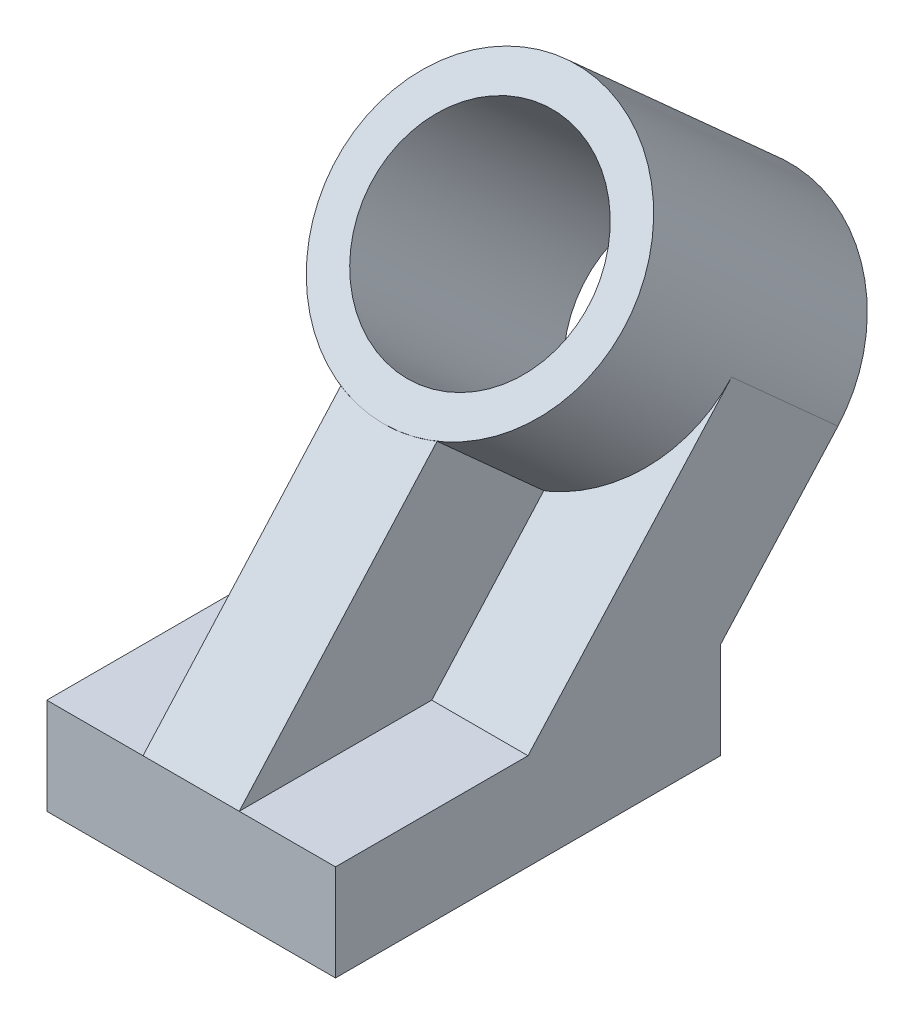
ISO-10303-21;
HEADER;
FILE_DESCRIPTION(('STEP AP214'),'2;1');
FILE_NAME('part.step','',(''),(''),'','','');
FILE_SCHEMA(('AUTOMOTIVE_DESIGN { 1 0 10303 214 1 1 1 1 }'));
ENDSEC;
DATA;
#1=APPLICATION_CONTEXT('core data for automotive mechanical design processes');
#2=APPLICATION_PROTOCOL_DEFINITION('international standard','automotive_design',2000,#1);
#3=PRODUCT_CONTEXT('',#1,'mechanical');
#4=PRODUCT('Part','Part','',(#3));
#5=PRODUCT_RELATED_PRODUCT_CATEGORY('part','',(#4));
#6=PRODUCT_DEFINITION_FORMATION('','',#4);
#7=PRODUCT_DEFINITION_CONTEXT('part definition',#1,'design');
#8=PRODUCT_DEFINITION('design','',#6,#7);
#9=PRODUCT_DEFINITION_SHAPE('','',#8);
#10=(LENGTH_UNIT() NAMED_UNIT(*) SI_UNIT(.MILLI.,.METRE.));
#11=(NAMED_UNIT(*) PLANE_ANGLE_UNIT() SI_UNIT($,.RADIAN.));
#12=(NAMED_UNIT(*) SI_UNIT($,.STERADIAN.) SOLID_ANGLE_UNIT());
#13=UNCERTAINTY_MEASURE_WITH_UNIT(LENGTH_MEASURE(1.E-05),#10,'distance_accuracy_value','');
#14=(GEOMETRIC_REPRESENTATION_CONTEXT(3) GLOBAL_UNCERTAINTY_ASSIGNED_CONTEXT((#13)) GLOBAL_UNIT_ASSIGNED_CONTEXT((#10,
#11,#12)) REPRESENTATION_CONTEXT('',''));
#15=CARTESIAN_POINT('',(0.,0.,0.));
#16=DIRECTION('',(0.,0.,1.));
#17=DIRECTION('',(1.,0.,0.));
#18=AXIS2_PLACEMENT_3D('',#15,#16,#17);
#19=CARTESIAN_POINT('',(38.1,25.4,50.8));
#20=DIRECTION('',(0.,-1.,0.));
#21=DIRECTION('',(0.,0.,-1.));
#22=AXIS2_PLACEMENT_3D('',#19,#20,#21);
#23=PLANE('',#22);
#24=DIRECTION('',(0.,0.,-1.));
#25=VECTOR('',#24,1.);
#26=CARTESIAN_POINT('',(-12.7,25.4,50.8));
#27=LINE('',#26,#25);
#28=CARTESIAN_POINT('',(-12.7,25.4,50.8));
#29=VERTEX_POINT('',#28);
#30=CARTESIAN_POINT('',(-12.7,25.4,0.));
#31=VERTEX_POINT('',#30);
#32=EDGE_CURVE('E70',#29,#31,#27,.T.);
#33=ORIENTED_EDGE('',*,*,#32,.T.);
#34=DIRECTION('',(-1.,0.,0.));
#35=VECTOR('',#34,1.);
#36=CARTESIAN_POINT('',(38.1,25.4,0.));
#37=LINE('',#36,#35);
#38=CARTESIAN_POINT('',(-38.1,25.4,0.));
#39=VERTEX_POINT('',#38);
#40=EDGE_CURVE('E223',#31,#39,#37,.T.);
#41=ORIENTED_EDGE('',*,*,#40,.T.);
#42=DIRECTION('',(0.,0.,1.));
#43=VECTOR('',#42,1.);
#44=CARTESIAN_POINT('',(-38.1,25.4,50.8));
#45=LINE('',#44,#43);
#46=CARTESIAN_POINT('',(-38.1,25.4,50.8));
#47=VERTEX_POINT('',#46);
#48=EDGE_CURVE('E153',#39,#47,#45,.T.);
#49=ORIENTED_EDGE('',*,*,#48,.T.);
#50=DIRECTION('',(-1.,0.,0.));
#51=VECTOR('',#50,1.);
#52=CARTESIAN_POINT('',(38.1,25.4,50.8));
#53=LINE('',#52,#51);
#54=EDGE_CURVE('E141',#29,#47,#53,.T.);
#55=ORIENTED_EDGE('',*,*,#54,.F.);
#56=EDGE_LOOP('',(#33,#41,#49,#55));
#57=FACE_BOUND('',#56,.T.);
#58=ADVANCED_FACE('F55',(#57),#23,.F.);
#59=CARTESIAN_POINT('',(38.1,25.4,0.));
#60=DIRECTION('',(0.,-0.669130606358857,-0.743144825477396));
#61=DIRECTION('',(0.,0.743144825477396,-0.669130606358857));
#62=AXIS2_PLACEMENT_3D('',#59,#60,#61);
#63=PLANE('',#62);
#64=CARTESIAN_POINT('',(0.,85.0805974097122,-53.7366512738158));
#65=DIRECTION('',(0.,0.669130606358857,0.743144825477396));
#66=DIRECTION('',(0.,-0.743144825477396,0.669130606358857));
#67=AXIS2_PLACEMENT_3D('',#64,#65,#66);
#68=CIRCLE('',#67,38.1);
#69=CARTESIAN_POINT('',(-38.1,85.0805974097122,-53.7366512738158));
#70=VERTEX_POINT('',#69);
#71=CARTESIAN_POINT('',(38.1,85.0805974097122,-53.7366512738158));
#72=VERTEX_POINT('',#71);
#73=EDGE_CURVE('E189',#70,#72,#68,.T.);
#74=ORIENTED_EDGE('',*,*,#73,.F.);
#75=DIRECTION('',(0.,-0.743144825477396,0.669130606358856));
#76=VECTOR('',#75,1.);
#77=CARTESIAN_POINT('',(-38.1,25.4,0.));
#78=LINE('',#77,#76);
#79=EDGE_CURVE('E219',#70,#39,#78,.T.);
#80=ORIENTED_EDGE('',*,*,#79,.T.);
#81=ORIENTED_EDGE('',*,*,#40,.F.);
#82=DIRECTION('',(-1.,0.,0.));
#83=VECTOR('',#82,1.);
#84=CARTESIAN_POINT('',(12.7,25.4,0.));
#85=LINE('',#84,#83);
#86=CARTESIAN_POINT('',(12.7,25.4,0.));
#87=VERTEX_POINT('',#86);
#88=EDGE_CURVE('E77',#87,#31,#85,.T.);
#89=ORIENTED_EDGE('',*,*,#88,.F.);
#90=CARTESIAN_POINT('',(38.1,25.4,0.));
#91=VERTEX_POINT('',#90);
#92=EDGE_CURVE('E224',#91,#87,#37,.T.);
#93=ORIENTED_EDGE('',*,*,#92,.F.);
#94=DIRECTION('',(0.,-0.743144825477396,0.669130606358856));
#95=VECTOR('',#94,1.);
#96=CARTESIAN_POINT('',(38.1,25.4,0.));
#97=LINE('',#96,#95);
#98=EDGE_CURVE('E208',#72,#91,#97,.T.);
#99=ORIENTED_EDGE('',*,*,#98,.F.);
#100=EDGE_LOOP('',(#74,#80,#81,#89,#93,#99));
#101=FACE_BOUND('',#100,.T.);
#102=ADVANCED_FACE('F244',(#101),#63,.F.);
#103=CARTESIAN_POINT('',(38.1,25.4,-50.8));
#104=DIRECTION('',(0.,0.669130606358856,0.743144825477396));
#105=DIRECTION('',(0.,-0.743144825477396,0.669130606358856));
#106=AXIS2_PLACEMENT_3D('',#103,#104,#105);
#107=PLANE('',#106);
#108=CARTESIAN_POINT('',(0.,59.8197412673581,-81.7916742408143));
#109=DIRECTION('',(0.,0.669130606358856,0.743144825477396));
#110=DIRECTION('',(0.,-0.743144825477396,0.669130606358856));
#111=AXIS2_PLACEMENT_3D('',#108,#109,#110);
#112=CIRCLE('',#111,28.575);
#113=CARTESIAN_POINT('',(0.,38.5843778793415,-62.67126716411));
#114=VERTEX_POINT('',#113);
#115=EDGE_CURVE('E186',#114,#114,#112,.F.);
#116=ORIENTED_EDGE('',*,*,#115,.F.);
#117=EDGE_LOOP('',(#116));
#118=FACE_BOUND('',#117,.T.);
#119=CARTESIAN_POINT('',(0.,59.8197412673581,-81.7916742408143));
#120=DIRECTION('',(0.,0.669130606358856,0.743144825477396));
#121=DIRECTION('',(0.,-0.743144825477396,0.669130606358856));
#122=AXIS2_PLACEMENT_3D('',#119,#120,#121);
#123=CIRCLE('',#122,38.1);
#124=CARTESIAN_POINT('',(38.1,59.8197412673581,-81.7916742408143));
#125=VERTEX_POINT('',#124);
#126=CARTESIAN_POINT('',(-38.1,59.8197412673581,-81.7916742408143));
#127=VERTEX_POINT('',#126);
#128=EDGE_CURVE('E193',#125,#127,#123,.T.);
#129=ORIENTED_EDGE('',*,*,#128,.F.);
#130=DIRECTION('',(0.,0.743144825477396,-0.669130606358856));
#131=VECTOR('',#130,1.);
#132=CARTESIAN_POINT('',(38.1,25.4,-50.8));
#133=LINE('',#132,#131);
#134=CARTESIAN_POINT('',(38.1,25.4,-50.8));
#135=VERTEX_POINT('',#134);
#136=EDGE_CURVE('E205',#135,#125,#133,.T.);
#137=ORIENTED_EDGE('',*,*,#136,.F.);
#138=DIRECTION('',(-1.,0.,0.));
#139=VECTOR('',#138,1.);
#140=CARTESIAN_POINT('',(38.1,25.4,-50.8));
#141=LINE('',#140,#139);
#142=CARTESIAN_POINT('',(-38.1,25.4,-50.8));
#143=VERTEX_POINT('',#142);
#144=EDGE_CURVE('E226',#135,#143,#141,.T.);
#145=ORIENTED_EDGE('',*,*,#144,.T.);
#146=DIRECTION('',(0.,0.743144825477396,-0.669130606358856));
#147=VECTOR('',#146,1.);
#148=CARTESIAN_POINT('',(-38.1,25.4,-50.8));
#149=LINE('',#148,#147);
#150=EDGE_CURVE('E216',#143,#127,#149,.T.);
#151=ORIENTED_EDGE('',*,*,#150,.T.);
#152=EDGE_LOOP('',(#129,#137,#145,#151));
#153=FACE_BOUND('',#152,.T.);
#154=ADVANCED_FACE('F252',(#118,#153),#107,.F.);
#155=CARTESIAN_POINT('',(38.1,0.,50.8));
#156=DIRECTION('',(0.,0.,-1.));
#157=DIRECTION('',(-1.,0.,0.));
#158=AXIS2_PLACEMENT_3D('',#155,#156,#157);
#159=PLANE('',#158);
#160=DIRECTION('',(0.,-1.,0.));
#161=VECTOR('',#160,1.);
#162=CARTESIAN_POINT('',(-38.1,0.,50.8));
#163=LINE('',#162,#161);
#164=CARTESIAN_POINT('',(-38.1,0.,50.8));
#165=VERTEX_POINT('',#164);
#166=EDGE_CURVE('E197',#47,#165,#163,.T.);
#167=ORIENTED_EDGE('',*,*,#166,.T.);
#168=DIRECTION('',(-1.,0.,0.));
#169=VECTOR('',#168,1.);
#170=CARTESIAN_POINT('',(38.1,0.,50.8));
#171=LINE('',#170,#169);
#172=CARTESIAN_POINT('',(38.1,0.,50.8));
#173=VERTEX_POINT('',#172);
#174=EDGE_CURVE('E232',#173,#165,#171,.T.);
#175=ORIENTED_EDGE('',*,*,#174,.F.);
#176=DIRECTION('',(0.,-1.,0.));
#177=VECTOR('',#176,1.);
#178=CARTESIAN_POINT('',(38.1,0.,50.8));
#179=LINE('',#178,#177);
#180=CARTESIAN_POINT('',(38.1,25.4,50.8));
#181=VERTEX_POINT('',#180);
#182=EDGE_CURVE('E198',#181,#173,#179,.T.);
#183=ORIENTED_EDGE('',*,*,#182,.F.);
#184=CARTESIAN_POINT('',(12.7,25.4,50.8));
#185=VERTEX_POINT('',#184);
#186=EDGE_CURVE('E145',#181,#185,#53,.T.);
#187=ORIENTED_EDGE('',*,*,#186,.T.);
#188=DIRECTION('',(-1.,0.,0.));
#189=VECTOR('',#188,1.);
#190=CARTESIAN_POINT('',(12.7,25.4,50.8));
#191=LINE('',#190,#189);
#192=EDGE_CURVE('E139',#185,#29,#191,.T.);
#193=ORIENTED_EDGE('',*,*,#192,.T.);
#194=ORIENTED_EDGE('',*,*,#54,.T.);
#195=EDGE_LOOP('',(#167,#175,#183,#187,#193,#194));
#196=FACE_BOUND('',#195,.T.);
#197=ADVANCED_FACE('F57',(#196),#159,.F.);
#198=CARTESIAN_POINT('',(38.1,0.,50.8));
#199=DIRECTION('',(0.,1.,0.));
#200=DIRECTION('',(0.,0.,1.));
#201=AXIS2_PLACEMENT_3D('',#198,#199,#200);
#202=PLANE('',#201);
#203=DIRECTION('',(0.,0.,-1.));
#204=VECTOR('',#203,1.);
#205=CARTESIAN_POINT('',(-38.1,0.,50.8));
#206=LINE('',#205,#204);
#207=CARTESIAN_POINT('',(-38.1,0.,-50.8));
#208=VERTEX_POINT('',#207);
#209=EDGE_CURVE('E212',#165,#208,#206,.T.);
#210=ORIENTED_EDGE('',*,*,#209,.T.);
#211=DIRECTION('',(-1.,0.,0.));
#212=VECTOR('',#211,1.);
#213=CARTESIAN_POINT('',(38.1,0.,-50.8));
#214=LINE('',#213,#212);
#215=CARTESIAN_POINT('',(38.1,0.,-50.8));
#216=VERTEX_POINT('',#215);
#217=EDGE_CURVE('E229',#216,#208,#214,.T.);
#218=ORIENTED_EDGE('',*,*,#217,.F.);
#219=DIRECTION('',(0.,0.,-1.));
#220=VECTOR('',#219,1.);
#221=CARTESIAN_POINT('',(38.1,0.,50.8));
#222=LINE('',#221,#220);
#223=EDGE_CURVE('E201',#173,#216,#222,.T.);
#224=ORIENTED_EDGE('',*,*,#223,.F.);
#225=ORIENTED_EDGE('',*,*,#174,.T.);
#226=EDGE_LOOP('',(#210,#218,#224,#225));
#227=FACE_BOUND('',#226,.T.);
#228=ADVANCED_FACE('F259',(#227),#202,.F.);
#229=CARTESIAN_POINT('',(38.1,0.,-50.8));
#230=DIRECTION('',(0.,0.,1.));
#231=DIRECTION('',(1.,0.,0.));
#232=AXIS2_PLACEMENT_3D('',#229,#230,#231);
#233=PLANE('',#232);
#234=DIRECTION('',(0.,1.,0.));
#235=VECTOR('',#234,1.);
#236=CARTESIAN_POINT('',(-38.1,0.,-50.8));
#237=LINE('',#236,#235);
#238=EDGE_CURVE('E214',#208,#143,#237,.T.);
#239=ORIENTED_EDGE('',*,*,#238,.T.);
#240=ORIENTED_EDGE('',*,*,#144,.F.);
#241=DIRECTION('',(0.,1.,0.));
#242=VECTOR('',#241,1.);
#243=CARTESIAN_POINT('',(38.1,0.,-50.8));
#244=LINE('',#243,#242);
#245=EDGE_CURVE('E203',#216,#135,#244,.T.);
#246=ORIENTED_EDGE('',*,*,#245,.F.);
#247=ORIENTED_EDGE('',*,*,#217,.T.);
#248=EDGE_LOOP('',(#239,#240,#246,#247));
#249=FACE_BOUND('',#248,.T.);
#250=ADVANCED_FACE('F256',(#249),#233,.F.);
#251=ORIENTED_EDGE('',*,*,#92,.T.);
#252=DIRECTION('',(0.,0.,-1.));
#253=VECTOR('',#252,1.);
#254=CARTESIAN_POINT('',(12.7,25.4,50.8));
#255=LINE('',#254,#253);
#256=EDGE_CURVE('E282',#185,#87,#255,.T.);
#257=ORIENTED_EDGE('',*,*,#256,.F.);
#258=ORIENTED_EDGE('',*,*,#186,.F.);
#259=DIRECTION('',(0.,0.,1.));
#260=VECTOR('',#259,1.);
#261=CARTESIAN_POINT('',(38.1,25.4,50.8));
#262=LINE('',#261,#260);
#263=EDGE_CURVE('E155',#91,#181,#262,.T.);
#264=ORIENTED_EDGE('',*,*,#263,.F.);
#265=EDGE_LOOP('',(#251,#257,#258,#264));
#266=FACE_BOUND('',#265,.T.);
#267=ADVANCED_FACE('F266',(#266),#23,.F.);
#268=CARTESIAN_POINT('',(38.1,0.,0.));
#269=DIRECTION('',(-1.,0.,0.));
#270=DIRECTION('',(0.,0.,1.));
#271=AXIS2_PLACEMENT_3D('',#268,#269,#270);
#272=PLANE('',#271);
#273=ORIENTED_EDGE('',*,*,#136,.T.);
#274=DIRECTION('',(0.,0.669130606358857,0.743144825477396));
#275=VECTOR('',#274,1.);
#276=CARTESIAN_POINT('',(38.1,59.5867213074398,-82.0504691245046));
#277=LINE('',#276,#275);
#278=EDGE_CURVE('E12',#125,#72,#277,.T.);
#279=ORIENTED_EDGE('',*,*,#278,.T.);
#280=ORIENTED_EDGE('',*,*,#98,.T.);
#281=ORIENTED_EDGE('',*,*,#263,.T.);
#282=ORIENTED_EDGE('',*,*,#182,.T.);
#283=ORIENTED_EDGE('',*,*,#223,.T.);
#284=ORIENTED_EDGE('',*,*,#245,.T.);
#285=EDGE_LOOP('',(#273,#279,#280,#281,#282,#283,#284));
#286=FACE_BOUND('',#285,.T.);
#287=ADVANCED_FACE('F247',(#286),#272,.F.);
#288=CARTESIAN_POINT('',(-38.1,0.,0.));
#289=DIRECTION('',(-1.,0.,0.));
#290=DIRECTION('',(0.,0.,1.));
#291=AXIS2_PLACEMENT_3D('',#288,#289,#290);
#292=PLANE('',#291);
#293=DIRECTION('',(0.,0.669130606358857,0.743144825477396));
#294=VECTOR('',#293,1.);
#295=CARTESIAN_POINT('',(-38.1,59.5867213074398,-82.0504691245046));
#296=LINE('',#295,#294);
#297=EDGE_CURVE('E63',#127,#70,#296,.T.);
#298=ORIENTED_EDGE('',*,*,#297,.F.);
#299=ORIENTED_EDGE('',*,*,#150,.F.);
#300=ORIENTED_EDGE('',*,*,#238,.F.);
#301=ORIENTED_EDGE('',*,*,#209,.F.);
#302=ORIENTED_EDGE('',*,*,#166,.F.);
#303=ORIENTED_EDGE('',*,*,#48,.F.);
#304=ORIENTED_EDGE('',*,*,#79,.F.);
#305=EDGE_LOOP('',(#298,#299,#300,#301,#302,#303,#304));
#306=FACE_BOUND('',#305,.T.);
#307=ADVANCED_FACE('F254',(#306),#292,.T.);
#308=CARTESIAN_POINT('',(0.,59.5867213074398,-82.0504691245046));
#309=DIRECTION('',(0.,0.669130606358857,0.743144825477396));
#310=DIRECTION('',(0.,-0.743144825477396,0.669130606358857));
#311=AXIS2_PLACEMENT_3D('',#308,#309,#310);
#312=CYLINDRICAL_SURFACE('',#311,38.1);
#313=DIRECTION('',(0.,0.669130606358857,0.743144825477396));
#314=VECTOR('',#313,1.);
#315=CARTESIAN_POINT('',(12.7,32.8921978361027,-58.0146122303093));
#316=LINE('',#315,#314);
#317=CARTESIAN_POINT('',(12.7,58.5067282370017,-29.5667942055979));
#318=VERTEX_POINT('',#317);
#319=CARTESIAN_POINT('',(12.7,83.859981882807,-1.40915341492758));
#320=VERTEX_POINT('',#319);
#321=EDGE_CURVE('E181',#318,#320,#316,.T.);
#322=ORIENTED_EDGE('',*,*,#321,.F.);
#323=CARTESIAN_POINT('',(0.,85.2988931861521,-53.4942092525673));
#324=DIRECTION('',(0.,0.66610621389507,0.74585689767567));
#325=DIRECTION('',(0.,0.74585689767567,-0.66610621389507));
#326=AXIS2_PLACEMENT_3D('',#323,#324,#325);
#327=ELLIPSE('',#326,38.1003143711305,38.1);
#328=CARTESIAN_POINT('',(-12.7,58.5067282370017,-29.5667942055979));
#329=VERTEX_POINT('',#328);
#330=EDGE_CURVE('E150',#318,#329,#327,.F.);
#331=ORIENTED_EDGE('',*,*,#330,.T.);
#332=DIRECTION('',(0.,0.669130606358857,0.743144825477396));
#333=VECTOR('',#332,1.);
#334=CARTESIAN_POINT('',(-12.7,32.8921978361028,-58.0146122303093));
#335=LINE('',#334,#333);
#336=CARTESIAN_POINT('',(-12.7,83.859981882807,-1.40915341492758));
#337=VERTEX_POINT('',#336);
#338=EDGE_CURVE('E179',#329,#337,#335,.T.);
#339=ORIENTED_EDGE('',*,*,#338,.T.);
#340=CARTESIAN_POINT('',(0.,110.652146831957,-25.336568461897));
#341=DIRECTION('',(0.,-0.66610621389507,-0.74585689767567));
#342=DIRECTION('',(0.,0.74585689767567,-0.66610621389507));
#343=AXIS2_PLACEMENT_3D('',#340,#341,#342);
#344=ELLIPSE('',#343,38.1003143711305,38.1);
#345=EDGE_CURVE('E161',#337,#320,#344,.F.);
#346=ORIENTED_EDGE('',*,*,#345,.T.);
#347=EDGE_LOOP('',(#322,#331,#339,#346));
#348=FACE_BOUND('',#347,.T.);
#349=ORIENTED_EDGE('',*,*,#128,.T.);
#350=ORIENTED_EDGE('',*,*,#297,.T.);
#351=ORIENTED_EDGE('',*,*,#73,.T.);
#352=ORIENTED_EDGE('',*,*,#278,.F.);
#353=EDGE_LOOP('',(#349,#350,#351,#352));
#354=FACE_BOUND('',#353,.T.);
#355=CARTESIAN_POINT('',(0.,110.574473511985,-25.422833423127));
#356=DIRECTION('',(0.,0.669130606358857,0.743144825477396));
#357=DIRECTION('',(0.,-0.743144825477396,0.669130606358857));
#358=AXIS2_PLACEMENT_3D('',#355,#356,#357);
#359=CIRCLE('',#358,38.1);
#360=CARTESIAN_POINT('',(0.,82.2606556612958,0.0710426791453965));
#361=VERTEX_POINT('',#360);
#362=EDGE_CURVE('E190',#361,#361,#359,.T.);
#363=ORIENTED_EDGE('',*,*,#362,.F.);
#364=EDGE_LOOP('',(#363));
#365=FACE_BOUND('',#364,.T.);
#366=ADVANCED_FACE('F238',(#348,#354,#365),#312,.T.);
#367=CARTESIAN_POINT('',(0.,110.574473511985,-25.422833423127));
#368=DIRECTION('',(0.,0.669130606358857,0.743144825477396));
#369=DIRECTION('',(0.,-0.743144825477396,0.669130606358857));
#370=AXIS2_PLACEMENT_3D('',#367,#368,#369);
#371=PLANE('',#370);
#372=CARTESIAN_POINT('',(0.,110.574473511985,-25.4228334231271));
#373=DIRECTION('',(0.,0.669130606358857,0.743144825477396));
#374=DIRECTION('',(0.,-0.743144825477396,0.669130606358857));
#375=AXIS2_PLACEMENT_3D('',#372,#373,#374);
#376=CIRCLE('',#375,28.575);
#377=CARTESIAN_POINT('',(0.,89.339110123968,-6.30242634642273));
#378=VERTEX_POINT('',#377);
#379=EDGE_CURVE('E183',#378,#378,#376,.T.);
#380=ORIENTED_EDGE('',*,*,#379,.F.);
#381=EDGE_LOOP('',(#380));
#382=FACE_BOUND('',#381,.T.);
#383=ORIENTED_EDGE('',*,*,#362,.T.);
#384=EDGE_LOOP('',(#383));
#385=FACE_BOUND('',#384,.T.);
#386=ADVANCED_FACE('F294',(#382,#385),#371,.T.);
#387=CARTESIAN_POINT('',(0.,20.3582494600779,-125.618100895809));
#388=DIRECTION('',(0.,0.669130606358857,0.743144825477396));
#389=DIRECTION('',(0.,-0.743144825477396,0.669130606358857));
#390=AXIS2_PLACEMENT_3D('',#387,#388,#389);
#391=CYLINDRICAL_SURFACE('',#390,28.575);
#392=ORIENTED_EDGE('',*,*,#379,.T.);
#393=EDGE_LOOP('',(#392));
#394=FACE_BOUND('',#393,.T.);
#395=ORIENTED_EDGE('',*,*,#115,.T.);
#396=EDGE_LOOP('',(#395));
#397=FACE_BOUND('',#396,.T.);
#398=ADVANCED_FACE('F300',(#394,#397),#391,.F.);
#399=CARTESIAN_POINT('',(12.7,89.339110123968,-6.30242634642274));
#400=DIRECTION('',(0.,-0.66610621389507,-0.74585689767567));
#401=DIRECTION('',(0.,0.74585689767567,-0.66610621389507));
#402=AXIS2_PLACEMENT_3D('',#399,#400,#401);
#403=PLANE('',#402);
#404=ORIENTED_EDGE('',*,*,#345,.F.);
#405=DIRECTION('',(0.,-0.74585689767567,0.66610621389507));
#406=VECTOR('',#405,1.);
#407=CARTESIAN_POINT('',(-12.7,89.339110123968,-6.30242634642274));
#408=LINE('',#407,#406);
#409=EDGE_CURVE('E158',#337,#29,#408,.T.);
#410=ORIENTED_EDGE('',*,*,#409,.T.);
#411=ORIENTED_EDGE('',*,*,#192,.F.);
#412=DIRECTION('',(0.,-0.74585689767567,0.66610621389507));
#413=VECTOR('',#412,1.);
#414=CARTESIAN_POINT('',(12.7,89.339110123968,-6.30242634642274));
#415=LINE('',#414,#413);
#416=EDGE_CURVE('E170',#320,#185,#415,.T.);
#417=ORIENTED_EDGE('',*,*,#416,.F.);
#418=EDGE_LOOP('',(#404,#410,#411,#417));
#419=FACE_BOUND('',#418,.T.);
#420=ADVANCED_FACE('F159',(#419),#403,.F.);
#421=CARTESIAN_POINT('',(12.7,25.4,0.));
#422=DIRECTION('',(0.,0.66610621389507,0.74585689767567));
#423=DIRECTION('',(0.,-0.74585689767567,0.66610621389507));
#424=AXIS2_PLACEMENT_3D('',#421,#422,#423);
#425=PLANE('',#424);
#426=ORIENTED_EDGE('',*,*,#330,.F.);
#427=DIRECTION('',(0.,0.74585689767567,-0.66610621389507));
#428=VECTOR('',#427,1.);
#429=CARTESIAN_POINT('',(12.7,25.4,0.));
#430=LINE('',#429,#428);
#431=EDGE_CURVE('E174',#87,#318,#430,.T.);
#432=ORIENTED_EDGE('',*,*,#431,.F.);
#433=ORIENTED_EDGE('',*,*,#88,.T.);
#434=DIRECTION('',(0.,0.74585689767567,-0.66610621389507));
#435=VECTOR('',#434,1.);
#436=CARTESIAN_POINT('',(-12.7,25.4,0.));
#437=LINE('',#436,#435);
#438=EDGE_CURVE('E168',#31,#329,#437,.T.);
#439=ORIENTED_EDGE('',*,*,#438,.T.);
#440=EDGE_LOOP('',(#426,#432,#433,#439));
#441=FACE_BOUND('',#440,.T.);
#442=ADVANCED_FACE('F290',(#441),#425,.F.);
#443=CARTESIAN_POINT('',(12.7,0.,0.));
#444=DIRECTION('',(1.,0.,0.));
#445=DIRECTION('',(0.,0.,-1.));
#446=AXIS2_PLACEMENT_3D('',#443,#444,#445);
#447=PLANE('',#446);
#448=ORIENTED_EDGE('',*,*,#431,.T.);
#449=ORIENTED_EDGE('',*,*,#321,.T.);
#450=ORIENTED_EDGE('',*,*,#416,.T.);
#451=ORIENTED_EDGE('',*,*,#256,.T.);
#452=EDGE_LOOP('',(#448,#449,#450,#451));
#453=FACE_BOUND('',#452,.T.);
#454=ADVANCED_FACE('F286',(#453),#447,.T.);
#455=CARTESIAN_POINT('',(-12.7,0.,0.));
#456=DIRECTION('',(1.,0.,0.));
#457=DIRECTION('',(0.,0.,-1.));
#458=AXIS2_PLACEMENT_3D('',#455,#456,#457);
#459=PLANE('',#458);
#460=ORIENTED_EDGE('',*,*,#338,.F.);
#461=ORIENTED_EDGE('',*,*,#438,.F.);
#462=ORIENTED_EDGE('',*,*,#32,.F.);
#463=ORIENTED_EDGE('',*,*,#409,.F.);
#464=EDGE_LOOP('',(#460,#461,#462,#463));
#465=FACE_BOUND('',#464,.T.);
#466=ADVANCED_FACE('F166',(#465),#459,.F.);
#467=CLOSED_SHELL('',(#58,#102,#154,#197,#228,#250,#267,#287,#307,#366,#386,#398,#420,#442,#454,#466));
#468=MANIFOLD_SOLID_BREP('B2',#467);
#469=ADVANCED_BREP_SHAPE_REPRESENTATION('',(#18,#468),#14);
#470=SHAPE_DEFINITION_REPRESENTATION(#9,#469);
ENDSEC;
END-ISO-10303-21;
